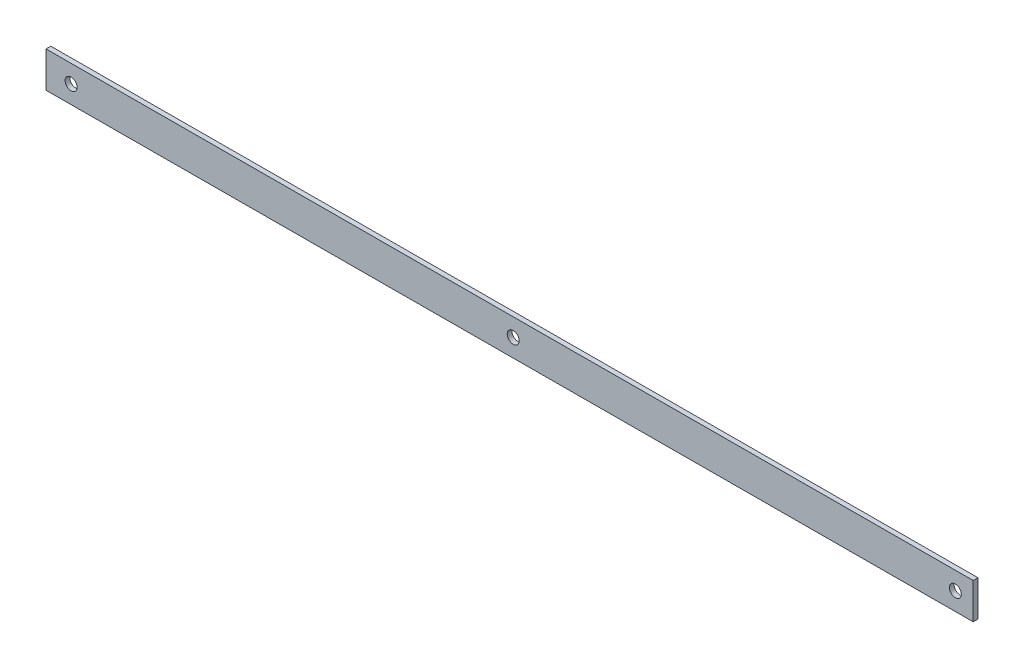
from build123d import *

# Parameters (mm, degrees)
ESQUISSE2_R      = 5
EXTRUSION1_DEPTH = 4


with BuildPart() as part:
    # Esquisse2 → Extrusion1 (new body)
    with BuildSketch(Plane.XY):
        Polygon((-485.079367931, -4.752442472), (291.915806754, -2.014100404), (291.915806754, -32.014286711), (-485.079367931, -34.752628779), align=None)
        with Locations((-464.079591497, -19.678526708)):
            Circle(ESQUISSE2_R, mode=Mode.SUBTRACT)
        with Locations((-93.581892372, -18.37279217)):
            Circle(ESQUISSE2_R, mode=Mode.SUBTRACT)
        with Locations((276.915806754, -17.067057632)):
            Circle(ESQUISSE2_R, mode=Mode.SUBTRACT)
    extrude(amount=EXTRUSION1_DEPTH)


solid = part.part
